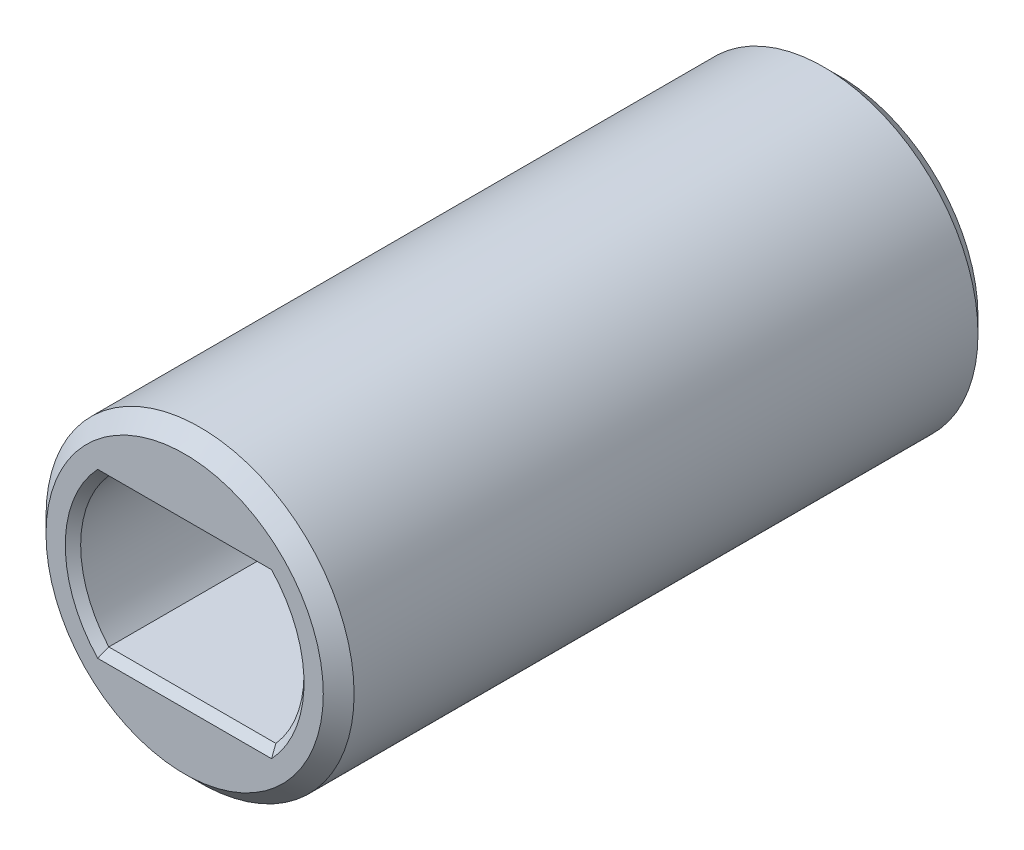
from build123d import *

# Parameters (mm, degrees)
SKICA1_R                 = 4
P_IDAT_VYSUNUT_M1_DEPTH  = 8.4
P_IDAT_START             = 8.6
SKICA2_R                 = 4
P_IDAT_VYSUNUT_M2_DEPTH  = 8.6
SKICA3_R                 = 1.9
ODEBRAT_VYSUNUT_M1_DEPTH = 7
ZKOSEN_2_SIZE            = 0.2
ZKOSEN_3_SIZE            = 0.4
P_IDAT_START_2           = 5.2
P_IDAT_VYSUNUT_M3_DEPTH  = 5.2


with BuildPart() as part:
    # Skica1 → P_idat vysunut_m1 (new body)
    with BuildSketch(Plane.XY):
        Circle(SKICA1_R)
        with BuildLine():
            Line((-2.168957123, 1.925), (2.168957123, 1.925))
            ThreePointArc((2.168957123, 1.925), (2.9, 0), (2.168957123, -1.925))
            Line((2.168957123, -1.925), (-2.168957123, -1.925))
            ThreePointArc((-2.168957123, -1.925), (-2.9, 0), (-2.168957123, 1.925))
        make_face(mode=Mode.SUBTRACT)
    extrude(amount=P_IDAT_VYSUNUT_M1_DEPTH)

    # Skica2 → P_idat vysunut_m2 (add)
    with BuildSketch(Plane(origin=(0, 0, 0), x_dir=(-1, 0, 0), z_dir=(0, 0, -1)).offset(P_IDAT_START)):
        Circle(SKICA2_R)
    extrude(amount=-P_IDAT_VYSUNUT_M2_DEPTH)

    # Skica3 → Odebrat vysunut_m1 (cut)
    with BuildSketch(Plane(origin=(0, 0, -8.6), x_dir=(-1, 0, 0), z_dir=(0, 0, -1))):
        Circle(SKICA3_R)
    extrude(amount=-ODEBRAT_VYSUNUT_M1_DEPTH, mode=Mode.SUBTRACT)

    # Zkosen_2
    zkosen_2_edges = [part.edges().sort_by_distance(p)[0] for p in [
        (0, 1.925, 8.4),
        (1.9, 0, -8.6),
        (-2.9, 0, 8.4),
        (0, -1.925, 8.4),
        (2.9, 0, 8.4),
    ]]
    chamfer(zkosen_2_edges, length=ZKOSEN_2_SIZE)

    # Zkosen_3
    zkosen_3_edges = [part.edges().sort_by_distance(p)[0] for p in [
        (4, 0, -8.6),
        (-4, 0, 8.4),
    ]]
    chamfer(zkosen_3_edges, length=ZKOSEN_3_SIZE)

    # Skica4 → P_idat vysunut_m3 (add)
    with BuildSketch(Plane(origin=(0, 0, -1.6), x_dir=(-1, 0, 0), z_dir=(0, 0, -1)).offset(P_IDAT_START_2)):
        with BuildLine():
            Line((-1.549193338, 1.1), (1.549193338, 1.1))
            ThreePointArc((1.549193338, 1.1), (0, 1.9), (-1.549193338, 1.1))
        make_face()
        with BuildLine():
            Line((-1.549193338, -1.1), (1.549193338, -1.1))
            ThreePointArc((1.549193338, -1.1), (0, -1.9), (-1.549193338, -1.1))
        make_face()
    extrude(amount=-P_IDAT_VYSUNUT_M3_DEPTH)


solid = part.part
